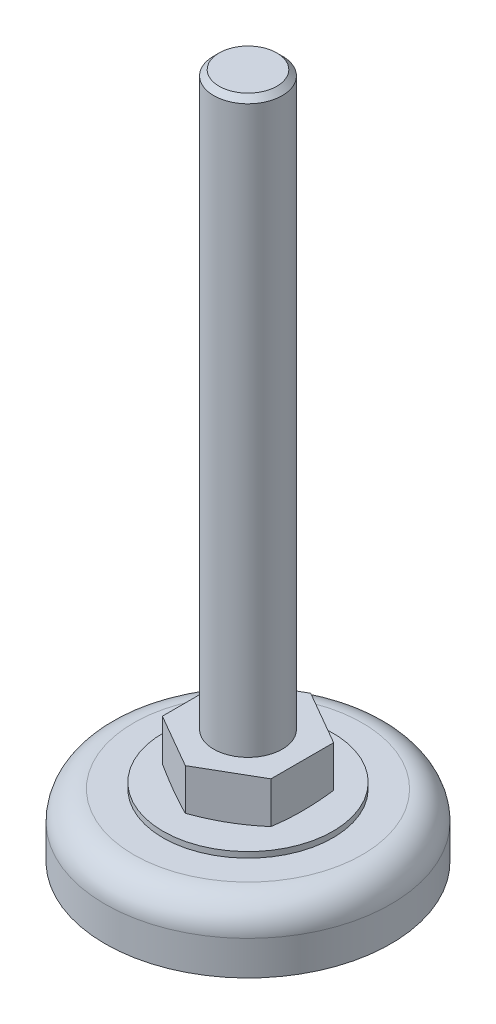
ISO-10303-21;
HEADER;
FILE_DESCRIPTION(('STEP AP214'),'2;1');
FILE_NAME('part.step','',(''),(''),'','','');
FILE_SCHEMA(('AUTOMOTIVE_DESIGN { 1 0 10303 214 1 1 1 1 }'));
ENDSEC;
DATA;
#1=APPLICATION_CONTEXT('core data for automotive mechanical design processes');
#2=APPLICATION_PROTOCOL_DEFINITION('international standard','automotive_design',2000,#1);
#3=PRODUCT_CONTEXT('',#1,'mechanical');
#4=PRODUCT('Part','Part','',(#3));
#5=PRODUCT_RELATED_PRODUCT_CATEGORY('part','',(#4));
#6=PRODUCT_DEFINITION_FORMATION('','',#4);
#7=PRODUCT_DEFINITION_CONTEXT('part definition',#1,'design');
#8=PRODUCT_DEFINITION('design','',#6,#7);
#9=PRODUCT_DEFINITION_SHAPE('','',#8);
#10=(LENGTH_UNIT() NAMED_UNIT(*) SI_UNIT(.MILLI.,.METRE.));
#11=(NAMED_UNIT(*) PLANE_ANGLE_UNIT() SI_UNIT($,.RADIAN.));
#12=(NAMED_UNIT(*) SI_UNIT($,.STERADIAN.) SOLID_ANGLE_UNIT());
#13=UNCERTAINTY_MEASURE_WITH_UNIT(LENGTH_MEASURE(1.E-05),#10,'distance_accuracy_value','');
#14=(GEOMETRIC_REPRESENTATION_CONTEXT(3) GLOBAL_UNCERTAINTY_ASSIGNED_CONTEXT((#13)) GLOBAL_UNIT_ASSIGNED_CONTEXT((#10,
#11,#12)) REPRESENTATION_CONTEXT('',''));
#15=CARTESIAN_POINT('',(0.,0.,0.));
#16=DIRECTION('',(0.,0.,1.));
#17=DIRECTION('',(1.,0.,0.));
#18=AXIS2_PLACEMENT_3D('',#15,#16,#17);
#19=CARTESIAN_POINT('',(0.,16.,0.));
#20=DIRECTION('',(0.,1.,0.));
#21=DIRECTION('',(0.,0.,1.));
#22=AXIS2_PLACEMENT_3D('',#19,#20,#21);
#23=CONICAL_SURFACE('',#22,8.,1.31824205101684);
#24=CARTESIAN_POINT('',(-9.5,18.4064858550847,-14.4882788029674));
#25=CARTESIAN_POINT('',(-9.5,18.3135363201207,-14.057459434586));
#26=CARTESIAN_POINT('',(-9.5,18.2217313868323,-13.626388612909));
#27=CARTESIAN_POINT('',(-9.5,18.0410270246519,-12.7636209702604));
#28=CARTESIAN_POINT('',(-9.5,17.9521277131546,-12.33192412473));
#29=CARTESIAN_POINT('',(-9.5,17.7777787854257,-11.467420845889));
#30=CARTESIAN_POINT('',(-9.5,17.692332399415,-11.0346137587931));
#31=CARTESIAN_POINT('',(-9.5,17.5258079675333,-10.1681604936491));
#32=CARTESIAN_POINT('',(-9.5,17.4447298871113,-9.73451432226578));
#33=CARTESIAN_POINT('',(-9.5,17.2885608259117,-8.86946261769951));
#34=CARTESIAN_POINT('',(-9.5,17.2134298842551,-8.43806433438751));
#35=CARTESIAN_POINT('',(-9.5,17.0697621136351,-7.57417304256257));
#36=CARTESIAN_POINT('',(-9.5,17.001225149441,-7.1416800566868));
#37=CARTESIAN_POINT('',(-9.5,16.8722886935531,-6.27552430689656));
#38=CARTESIAN_POINT('',(-9.5,16.8118882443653,-5.84186168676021));
#39=CARTESIAN_POINT('',(-9.5,16.7010024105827,-4.97325626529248));
#40=CARTESIAN_POINT('',(-9.5,16.6505170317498,-4.5383134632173));
#41=CARTESIAN_POINT('',(-9.5,16.5609238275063,-3.66262834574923));
#42=CARTESIAN_POINT('',(-9.5,16.5219409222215,-3.22187305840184));
#43=CARTESIAN_POINT('',(-9.5,16.4579683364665,-2.33933938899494));
#44=CARTESIAN_POINT('',(-9.5,16.4329783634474,-1.89756102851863));
#45=CARTESIAN_POINT('',(-9.5,16.398434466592,-1.01357299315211));
#46=CARTESIAN_POINT('',(-9.5,16.3888741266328,-0.57136357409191));
#47=CARTESIAN_POINT('',(-9.5,16.3857723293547,0.313112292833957));
#48=CARTESIAN_POINT('',(-9.5,16.3922308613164,0.755378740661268));
#49=CARTESIAN_POINT('',(-9.5,16.4208049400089,1.6409057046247));
#50=CARTESIAN_POINT('',(-9.5,16.442973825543,2.08416446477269));
#51=CARTESIAN_POINT('',(-9.5,16.50171377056,2.9697178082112));
#52=CARTESIAN_POINT('',(-9.5,16.5382851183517,3.41201237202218));
#53=CARTESIAN_POINT('',(-9.5,16.6239980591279,4.29563026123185));
#54=CARTESIAN_POINT('',(-9.5,16.6731471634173,4.73695284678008));
#55=CARTESIAN_POINT('',(-9.5,16.7819865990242,5.61828182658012));
#56=CARTESIAN_POINT('',(-9.5,16.8416769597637,6.05828821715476));
#57=CARTESIAN_POINT('',(-9.5,16.9661091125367,6.91238282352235));
#58=CARTESIAN_POINT('',(-9.5,17.0303797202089,7.32654037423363));
#59=CARTESIAN_POINT('',(-9.5,17.1652324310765,8.15383175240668));
#60=CARTESIAN_POINT('',(-9.5,17.2358146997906,8.5669655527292));
#61=CARTESIAN_POINT('',(-9.5,17.382132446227,9.39235635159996));
#62=CARTESIAN_POINT('',(-9.5,17.4578684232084,9.80461326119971));
#63=CARTESIAN_POINT('',(-9.5,17.6135388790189,10.6283269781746));
#64=CARTESIAN_POINT('',(-9.5,17.6934733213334,11.039783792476));
#65=CARTESIAN_POINT('',(-9.5,17.8567973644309,11.8621121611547));
#66=CARTESIAN_POINT('',(-9.5,17.9401877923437,12.2729835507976));
#67=CARTESIAN_POINT('',(-9.5,18.1098011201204,13.0941421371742));
#68=CARTESIAN_POINT('',(-9.5,18.196024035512,13.5044293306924));
#69=CARTESIAN_POINT('',(-9.5,18.4581734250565,14.7344932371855));
#70=CARTESIAN_POINT('',(-9.5,18.6375912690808,15.5535255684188));
#71=CARTESIAN_POINT('',(-9.5,19.0012065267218,17.1825154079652));
#72=CARTESIAN_POINT('',(-9.5,19.1853438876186,17.9924864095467));
#73=CARTESIAN_POINT('',(-9.5,19.5582304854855,19.6113792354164));
#74=CARTESIAN_POINT('',(-9.5,19.7469798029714,20.4203010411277));
#75=CARTESIAN_POINT('',(-9.5,20.1276507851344,22.0363851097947));
#76=CARTESIAN_POINT('',(-9.5,20.3195684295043,22.8435483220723));
#77=CARTESIAN_POINT('',(-9.5,20.7060161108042,24.4572229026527));
#78=CARTESIAN_POINT('',(-9.5,20.9005460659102,25.2637342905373));
#79=CARTESIAN_POINT('',(-9.5,21.0959995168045,26.0700192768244));
#80=B_SPLINE_CURVE_WITH_KNOTS('',3,(#24,#25,#26,#27,#28,#29,#30,#31,#32,#33,#34,#35,#36,#37,#38,
#39,#40,#41,#42,#43,#44,#45,#46,#47,#48,#49,#50,#51,#52,#53,#54,#55,#56,#57,#58,#59,#60,#61,#62,
#63,#64,#65,#66,#67,#68,#69,#70,#71,#72,#73,#74,#75,#76,#77,#78,#79),.UNSPECIFIED.,.F.,.F.,(4,2,
2,2,2,2,2,2,2,2,2,2,2,2,2,2,2,2,2,2,2,2,2,2,2,2,2,4),(0.,1.32220188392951,2.64445712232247,
3.96792197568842,5.29137635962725,6.60501058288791,7.91861786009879,9.23207041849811,
10.5455237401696,11.8727566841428,13.1999618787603,14.5266150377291,15.8532673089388,
17.1844454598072,18.5156502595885,19.8476519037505,21.1796572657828,22.4369438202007,
23.6942633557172,24.9517048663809,26.2091354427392,27.466868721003,28.7246088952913,
31.2399261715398,33.7318247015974,36.2237667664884,38.7127586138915,41.2016726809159),.UNSPECIFIED.);
#81=CARTESIAN_POINT('',(-9.5,16.7663626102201,5.48482755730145));
#82=VERTEX_POINT('',#81);
#83=CARTESIAN_POINT('',(-9.5,16.7663626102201,-5.48482755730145));
#84=VERTEX_POINT('',#83);
#85=EDGE_CURVE('E150',#82,#84,#80,.F.);
#86=ORIENTED_EDGE('',*,*,#85,.T.);
#87=CARTESIAN_POINT('',(-9.5002,16.7663924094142,-5.48471208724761));
#88=CARTESIAN_POINT('',(-9.10557748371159,16.7075718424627,-5.71254750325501));
#89=CARTESIAN_POINT('',(-8.71029047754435,16.6541818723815,-5.94076656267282));
#90=CARTESIAN_POINT('',(-7.91842136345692,16.5603919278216,-6.39795240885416));
#91=CARTESIAN_POINT('',(-7.52183882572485,16.5199968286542,-6.62691944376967));
#92=CARTESIAN_POINT('',(-6.72961048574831,16.4545299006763,-7.08431268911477));
#93=CARTESIAN_POINT('',(-6.33396929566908,16.429385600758,-7.31273623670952));
#94=CARTESIAN_POINT('',(-5.54221867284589,16.3956705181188,-7.76985367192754));
#95=CARTESIAN_POINT('',(-5.14610933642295,16.3870967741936,-7.99854750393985));
#96=CARTESIAN_POINT('',(-4.35389066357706,16.3870967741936,-8.45593516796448));
#97=CARTESIAN_POINT('',(-3.95778132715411,16.3956705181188,-8.68462899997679));
#98=CARTESIAN_POINT('',(-3.16603070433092,16.429385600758,-9.14174643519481));
#99=CARTESIAN_POINT('',(-2.77038951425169,16.4545299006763,-9.37016998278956));
#100=CARTESIAN_POINT('',(-1.97816117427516,16.5199968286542,-9.82756322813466));
#101=CARTESIAN_POINT('',(-1.58157863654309,16.5603919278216,-10.0565302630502));
#102=CARTESIAN_POINT('',(-0.789709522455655,16.6541818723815,-10.5137161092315));
#103=CARTESIAN_POINT('',(-0.394422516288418,16.7075718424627,-10.7419351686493));
#104=CARTESIAN_POINT('',(0.000199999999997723,16.7663924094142,-10.9697705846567));
#105=B_SPLINE_CURVE_WITH_KNOTS('',3,(#87,#88,#89,#90,#91,#92,#93,#94,#95,#96,#97,#98,#99,#100,
#101,#102,#103,#104),.UNSPECIFIED.,.F.,.F.,(4,2,2,2,2,2,2,2,4),(0.,1.37842136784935,
2.75735927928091,4.12969212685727,5.50177971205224,6.8738672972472,8.24620014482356,
9.62513805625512,11.0035594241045),.UNSPECIFIED.);
#106=CARTESIAN_POINT('',(0.,16.7663626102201,-10.9696551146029));
#107=VERTEX_POINT('',#106);
#108=EDGE_CURVE('E159',#84,#107,#105,.T.);
#109=ORIENTED_EDGE('',*,*,#108,.T.);
#110=CARTESIAN_POINT('',(-0.0002,16.7663924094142,-10.9697705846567));
#111=CARTESIAN_POINT('',(0.394422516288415,16.7075718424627,-10.7419351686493));
#112=CARTESIAN_POINT('',(0.789709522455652,16.6541818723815,-10.5137161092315));
#113=CARTESIAN_POINT('',(1.58157863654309,16.5603919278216,-10.0565302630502));
#114=CARTESIAN_POINT('',(1.97816117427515,16.5199968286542,-9.82756322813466));
#115=CARTESIAN_POINT('',(2.77038951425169,16.4545299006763,-9.37016998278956));
#116=CARTESIAN_POINT('',(3.16603070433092,16.429385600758,-9.14174643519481));
#117=CARTESIAN_POINT('',(3.95778132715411,16.3956705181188,-8.68462899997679));
#118=CARTESIAN_POINT('',(4.35389066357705,16.3870967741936,-8.45593516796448));
#119=CARTESIAN_POINT('',(5.14610933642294,16.3870967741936,-7.99854750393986));
#120=CARTESIAN_POINT('',(5.54221867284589,16.3956705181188,-7.76985367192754));
#121=CARTESIAN_POINT('',(6.33396929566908,16.429385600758,-7.31273623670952));
#122=CARTESIAN_POINT('',(6.72961048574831,16.4545299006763,-7.08431268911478));
#123=CARTESIAN_POINT('',(7.52183882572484,16.5199968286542,-6.62691944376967));
#124=CARTESIAN_POINT('',(7.91842136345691,16.5603919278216,-6.39795240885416));
#125=CARTESIAN_POINT('',(8.71029047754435,16.6541818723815,-5.94076656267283));
#126=CARTESIAN_POINT('',(9.10557748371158,16.7075718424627,-5.71254750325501));
#127=CARTESIAN_POINT('',(9.5002,16.7663924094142,-5.48471208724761));
#128=B_SPLINE_CURVE_WITH_KNOTS('',3,(#110,#111,#112,#113,#114,#115,#116,#117,#118,#119,#120,
#121,#122,#123,#124,#125,#126,#127),.UNSPECIFIED.,.F.,.F.,(4,2,2,2,2,2,2,2,4),(0.,
1.37842136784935,2.75735927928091,4.12969212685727,5.50177971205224,6.8738672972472,
8.24620014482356,9.62513805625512,11.0035594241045),.UNSPECIFIED.);
#129=CARTESIAN_POINT('',(9.5,16.7663626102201,-5.48482755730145));
#130=VERTEX_POINT('',#129);
#131=EDGE_CURVE('E92',#107,#130,#128,.T.);
#132=ORIENTED_EDGE('',*,*,#131,.T.);
#133=CARTESIAN_POINT('',(9.5,18.4064858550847,-14.4882788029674));
#134=CARTESIAN_POINT('',(9.5,18.3135363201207,-14.057459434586));
#135=CARTESIAN_POINT('',(9.5,18.2217313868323,-13.626388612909));
#136=CARTESIAN_POINT('',(9.5,18.0410270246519,-12.7636209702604));
#137=CARTESIAN_POINT('',(9.5,17.9521277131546,-12.33192412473));
#138=CARTESIAN_POINT('',(9.5,17.7777787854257,-11.467420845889));
#139=CARTESIAN_POINT('',(9.5,17.692332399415,-11.0346137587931));
#140=CARTESIAN_POINT('',(9.5,17.5258079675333,-10.1681604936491));
#141=CARTESIAN_POINT('',(9.5,17.4447298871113,-9.73451432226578));
#142=CARTESIAN_POINT('',(9.5,17.2885608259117,-8.86946261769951));
#143=CARTESIAN_POINT('',(9.5,17.2134298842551,-8.43806433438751));
#144=CARTESIAN_POINT('',(9.5,17.0697621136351,-7.57417304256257));
#145=CARTESIAN_POINT('',(9.5,17.001225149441,-7.1416800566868));
#146=CARTESIAN_POINT('',(9.5,16.8722886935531,-6.27552430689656));
#147=CARTESIAN_POINT('',(9.5,16.8118882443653,-5.84186168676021));
#148=CARTESIAN_POINT('',(9.5,16.7010024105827,-4.97325626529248));
#149=CARTESIAN_POINT('',(9.5,16.6505170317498,-4.5383134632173));
#150=CARTESIAN_POINT('',(9.5,16.5609238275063,-3.66262834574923));
#151=CARTESIAN_POINT('',(9.5,16.5219409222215,-3.22187305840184));
#152=CARTESIAN_POINT('',(9.5,16.4579683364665,-2.33933938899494));
#153=CARTESIAN_POINT('',(9.5,16.4329783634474,-1.89756102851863));
#154=CARTESIAN_POINT('',(9.5,16.398434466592,-1.01357299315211));
#155=CARTESIAN_POINT('',(9.5,16.3888741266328,-0.57136357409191));
#156=CARTESIAN_POINT('',(9.5,16.3857723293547,0.313112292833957));
#157=CARTESIAN_POINT('',(9.5,16.3922308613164,0.755378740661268));
#158=CARTESIAN_POINT('',(9.5,16.4208049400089,1.6409057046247));
#159=CARTESIAN_POINT('',(9.5,16.442973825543,2.08416446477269));
#160=CARTESIAN_POINT('',(9.5,16.50171377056,2.9697178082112));
#161=CARTESIAN_POINT('',(9.5,16.5382851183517,3.41201237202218));
#162=CARTESIAN_POINT('',(9.5,16.6239980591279,4.29563026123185));
#163=CARTESIAN_POINT('',(9.5,16.6731471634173,4.73695284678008));
#164=CARTESIAN_POINT('',(9.5,16.7819865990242,5.61828182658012));
#165=CARTESIAN_POINT('',(9.5,16.8416769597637,6.05828821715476));
#166=CARTESIAN_POINT('',(9.5,16.9661091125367,6.91238282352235));
#167=CARTESIAN_POINT('',(9.5,17.0303797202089,7.32654037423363));
#168=CARTESIAN_POINT('',(9.5,17.1652324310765,8.15383175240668));
#169=CARTESIAN_POINT('',(9.5,17.2358146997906,8.5669655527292));
#170=CARTESIAN_POINT('',(9.5,17.382132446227,9.39235635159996));
#171=CARTESIAN_POINT('',(9.5,17.4578684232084,9.80461326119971));
#172=CARTESIAN_POINT('',(9.5,17.6135388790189,10.6283269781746));
#173=CARTESIAN_POINT('',(9.5,17.6934733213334,11.039783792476));
#174=CARTESIAN_POINT('',(9.5,17.8567973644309,11.8621121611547));
#175=CARTESIAN_POINT('',(9.5,17.9401877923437,12.2729835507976));
#176=CARTESIAN_POINT('',(9.5,18.1098011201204,13.0941421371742));
#177=CARTESIAN_POINT('',(9.5,18.196024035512,13.5044293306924));
#178=CARTESIAN_POINT('',(9.5,18.4581734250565,14.7344932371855));
#179=CARTESIAN_POINT('',(9.5,18.6375912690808,15.5535255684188));
#180=CARTESIAN_POINT('',(9.5,19.0012065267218,17.1825154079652));
#181=CARTESIAN_POINT('',(9.5,19.1853438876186,17.9924864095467));
#182=CARTESIAN_POINT('',(9.5,19.5582304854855,19.6113792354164));
#183=CARTESIAN_POINT('',(9.5,19.7469798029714,20.4203010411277));
#184=CARTESIAN_POINT('',(9.5,20.1276507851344,22.0363851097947));
#185=CARTESIAN_POINT('',(9.5,20.3195684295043,22.8435483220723));
#186=CARTESIAN_POINT('',(9.5,20.7060161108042,24.4572229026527));
#187=CARTESIAN_POINT('',(9.5,20.9005460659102,25.2637342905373));
#188=CARTESIAN_POINT('',(9.5,21.0959995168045,26.0700192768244));
#189=B_SPLINE_CURVE_WITH_KNOTS('',3,(#133,#134,#135,#136,#137,#138,#139,#140,#141,#142,#143,
#144,#145,#146,#147,#148,#149,#150,#151,#152,#153,#154,#155,#156,#157,#158,#159,#160,#161,#162,
#163,#164,#165,#166,#167,#168,#169,#170,#171,#172,#173,#174,#175,#176,#177,#178,#179,#180,#181,
#182,#183,#184,#185,#186,#187,#188),.UNSPECIFIED.,.F.,.F.,(4,2,2,2,2,2,2,2,2,2,2,2,2,2,2,2,2,2,
2,2,2,2,2,2,2,2,2,4),(0.,1.32220188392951,2.64445712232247,3.96792197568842,5.29137635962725,
6.60501058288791,7.91861786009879,9.23207041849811,10.5455237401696,11.8727566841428,
13.1999618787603,14.5266150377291,15.8532673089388,17.1844454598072,18.5156502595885,
19.8476519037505,21.1796572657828,22.4369438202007,23.6942633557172,24.9517048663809,
26.2091354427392,27.466868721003,28.7246088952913,31.2399261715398,33.7318247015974,
36.2237667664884,38.7127586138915,41.2016726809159),.UNSPECIFIED.);
#190=CARTESIAN_POINT('',(9.5,16.7663626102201,5.48482755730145));
#191=VERTEX_POINT('',#190);
#192=EDGE_CURVE('E91',#130,#191,#189,.T.);
#193=ORIENTED_EDGE('',*,*,#192,.T.);
#194=CARTESIAN_POINT('',(9.5002,16.7663924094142,5.48471208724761));
#195=CARTESIAN_POINT('',(9.10557748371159,16.7075718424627,5.71254750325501));
#196=CARTESIAN_POINT('',(8.71029047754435,16.6541818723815,5.94076656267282));
#197=CARTESIAN_POINT('',(7.91842136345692,16.5603919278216,6.39795240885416));
#198=CARTESIAN_POINT('',(7.52183882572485,16.5199968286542,6.62691944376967));
#199=CARTESIAN_POINT('',(6.72961048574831,16.4545299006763,7.08431268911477));
#200=CARTESIAN_POINT('',(6.33396929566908,16.429385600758,7.31273623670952));
#201=CARTESIAN_POINT('',(5.54221867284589,16.3956705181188,7.76985367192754));
#202=CARTESIAN_POINT('',(5.14610933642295,16.3870967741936,7.99854750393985));
#203=CARTESIAN_POINT('',(4.35389066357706,16.3870967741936,8.45593516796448));
#204=CARTESIAN_POINT('',(3.95778132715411,16.3956705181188,8.68462899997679));
#205=CARTESIAN_POINT('',(3.16603070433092,16.429385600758,9.14174643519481));
#206=CARTESIAN_POINT('',(2.77038951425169,16.4545299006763,9.37016998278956));
#207=CARTESIAN_POINT('',(1.97816117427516,16.5199968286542,9.82756322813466));
#208=CARTESIAN_POINT('',(1.58157863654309,16.5603919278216,10.0565302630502));
#209=CARTESIAN_POINT('',(0.789709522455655,16.6541818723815,10.5137161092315));
#210=CARTESIAN_POINT('',(0.394422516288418,16.7075718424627,10.7419351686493));
#211=CARTESIAN_POINT('',(-0.000199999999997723,16.7663924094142,10.9697705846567));
#212=B_SPLINE_CURVE_WITH_KNOTS('',3,(#194,#195,#196,#197,#198,#199,#200,#201,#202,#203,#204,
#205,#206,#207,#208,#209,#210,#211),.UNSPECIFIED.,.F.,.F.,(4,2,2,2,2,2,2,2,4),(0.,
1.37842136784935,2.75735927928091,4.12969212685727,5.50177971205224,6.8738672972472,
8.24620014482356,9.62513805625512,11.0035594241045),.UNSPECIFIED.);
#213=CARTESIAN_POINT('',(0.,16.7663626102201,10.9696551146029));
#214=VERTEX_POINT('',#213);
#215=EDGE_CURVE('E108',#191,#214,#212,.T.);
#216=ORIENTED_EDGE('',*,*,#215,.T.);
#217=CARTESIAN_POINT('',(0.0002,16.7663924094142,10.9697705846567));
#218=CARTESIAN_POINT('',(-0.394422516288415,16.7075718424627,10.7419351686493));
#219=CARTESIAN_POINT('',(-0.789709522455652,16.6541818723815,10.5137161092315));
#220=CARTESIAN_POINT('',(-1.58157863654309,16.5603919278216,10.0565302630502));
#221=CARTESIAN_POINT('',(-1.97816117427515,16.5199968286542,9.82756322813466));
#222=CARTESIAN_POINT('',(-2.77038951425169,16.4545299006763,9.37016998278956));
#223=CARTESIAN_POINT('',(-3.16603070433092,16.429385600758,9.14174643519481));
#224=CARTESIAN_POINT('',(-3.95778132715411,16.3956705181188,8.68462899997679));
#225=CARTESIAN_POINT('',(-4.35389066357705,16.3870967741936,8.45593516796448));
#226=CARTESIAN_POINT('',(-5.14610933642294,16.3870967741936,7.99854750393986));
#227=CARTESIAN_POINT('',(-5.54221867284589,16.3956705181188,7.76985367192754));
#228=CARTESIAN_POINT('',(-6.33396929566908,16.429385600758,7.31273623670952));
#229=CARTESIAN_POINT('',(-6.72961048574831,16.4545299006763,7.08431268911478));
#230=CARTESIAN_POINT('',(-7.52183882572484,16.5199968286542,6.62691944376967));
#231=CARTESIAN_POINT('',(-7.91842136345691,16.5603919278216,6.39795240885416));
#232=CARTESIAN_POINT('',(-8.71029047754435,16.6541818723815,5.94076656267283));
#233=CARTESIAN_POINT('',(-9.10557748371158,16.7075718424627,5.71254750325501));
#234=CARTESIAN_POINT('',(-9.5002,16.7663924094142,5.48471208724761));
#235=B_SPLINE_CURVE_WITH_KNOTS('',3,(#217,#218,#219,#220,#221,#222,#223,#224,#225,#226,#227,
#228,#229,#230,#231,#232,#233,#234),.UNSPECIFIED.,.F.,.F.,(4,2,2,2,2,2,2,2,4),(0.,
1.37842136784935,2.75735927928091,4.12969212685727,5.50177971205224,6.8738672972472,
8.24620014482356,9.62513805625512,11.0035594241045),.UNSPECIFIED.);
#236=EDGE_CURVE('E142',#214,#82,#235,.T.);
#237=ORIENTED_EDGE('',*,*,#236,.T.);
#238=EDGE_LOOP('',(#86,#109,#132,#193,#216,#237));
#239=FACE_BOUND('',#238,.T.);
#240=CARTESIAN_POINT('',(0.,16.,0.));
#241=DIRECTION('',(0.,1.,0.));
#242=DIRECTION('',(0.,0.,1.));
#243=AXIS2_PLACEMENT_3D('',#240,#241,#242);
#244=CIRCLE('',#243,8.);
#245=CARTESIAN_POINT('',(0.,16.,8.));
#246=VERTEX_POINT('',#245);
#247=EDGE_CURVE('E217',#246,#246,#244,.T.);
#248=ORIENTED_EDGE('',*,*,#247,.T.);
#249=EDGE_LOOP('',(#248));
#250=FACE_BOUND('',#249,.T.);
#251=ADVANCED_FACE('F36',(#239,#250),#23,.T.);
#252=CARTESIAN_POINT('',(8.,16.,0.));
#253=DIRECTION('',(0.,-1.,0.));
#254=DIRECTION('',(0.,0.,-1.));
#255=AXIS2_PLACEMENT_3D('',#252,#253,#254);
#256=PLANE('',#255);
#257=ORIENTED_EDGE('',*,*,#247,.F.);
#258=EDGE_LOOP('',(#257));
#259=FACE_BOUND('',#258,.T.);
#260=CARTESIAN_POINT('',(0.,16.,0.));
#261=DIRECTION('',(0.,1.,0.));
#262=DIRECTION('',(0.,0.,1.));
#263=AXIS2_PLACEMENT_3D('',#260,#261,#262);
#264=CIRCLE('',#263,14.875);
#265=CARTESIAN_POINT('',(0.,16.,14.875));
#266=VERTEX_POINT('',#265);
#267=EDGE_CURVE('E220',#266,#266,#264,.T.);
#268=ORIENTED_EDGE('',*,*,#267,.T.);
#269=EDGE_LOOP('',(#268));
#270=FACE_BOUND('',#269,.T.);
#271=ADVANCED_FACE('F206',(#259,#270),#256,.F.);
#272=CARTESIAN_POINT('',(0.,0.,0.));
#273=DIRECTION('',(0.,1.,0.));
#274=DIRECTION('',(0.,0.,1.));
#275=AXIS2_PLACEMENT_3D('',#272,#273,#274);
#276=CYLINDRICAL_SURFACE('',#275,14.875);
#277=ORIENTED_EDGE('',*,*,#267,.F.);
#278=EDGE_LOOP('',(#277));
#279=FACE_BOUND('',#278,.T.);
#280=CARTESIAN_POINT('',(0.,15.,0.));
#281=DIRECTION('',(0.,1.,0.));
#282=DIRECTION('',(0.,0.,1.));
#283=AXIS2_PLACEMENT_3D('',#280,#281,#282);
#284=CIRCLE('',#283,14.875);
#285=CARTESIAN_POINT('',(0.,15.,14.875));
#286=VERTEX_POINT('',#285);
#287=EDGE_CURVE('E221',#286,#286,#284,.T.);
#288=ORIENTED_EDGE('',*,*,#287,.T.);
#289=EDGE_LOOP('',(#288));
#290=FACE_BOUND('',#289,.T.);
#291=ADVANCED_FACE('F203',(#279,#290),#276,.T.);
#292=CARTESIAN_POINT('',(14.875,15.,0.));
#293=DIRECTION('',(0.,-1.,0.));
#294=DIRECTION('',(0.,0.,-1.));
#295=AXIS2_PLACEMENT_3D('',#292,#293,#294);
#296=PLANE('',#295);
#297=ORIENTED_EDGE('',*,*,#287,.F.);
#298=EDGE_LOOP('',(#297));
#299=FACE_BOUND('',#298,.T.);
#300=CARTESIAN_POINT('',(0.,15.,0.));
#301=DIRECTION('',(0.,1.,0.));
#302=DIRECTION('',(0.,0.,1.));
#303=AXIS2_PLACEMENT_3D('',#300,#301,#302);
#304=CIRCLE('',#303,20.);
#305=CARTESIAN_POINT('',(0.,15.,20.));
#306=VERTEX_POINT('',#305);
#307=EDGE_CURVE('E226',#306,#306,#304,.T.);
#308=ORIENTED_EDGE('',*,*,#307,.T.);
#309=EDGE_LOOP('',(#308));
#310=FACE_BOUND('',#309,.T.);
#311=ADVANCED_FACE('F199',(#299,#310),#296,.F.);
#312=CARTESIAN_POINT('',(0.,10.,0.));
#313=DIRECTION('',(0.,1.,0.));
#314=DIRECTION('',(0.,0.,1.));
#315=AXIS2_PLACEMENT_3D('',#312,#313,#314);
#316=TOROIDAL_SURFACE('',#315,20.,5.);
#317=ORIENTED_EDGE('',*,*,#307,.F.);
#318=EDGE_LOOP('',(#317));
#319=FACE_BOUND('',#318,.T.);
#320=CARTESIAN_POINT('',(0.,10.,0.));
#321=DIRECTION('',(0.,1.,0.));
#322=DIRECTION('',(0.,0.,1.));
#323=AXIS2_PLACEMENT_3D('',#320,#321,#322);
#324=CIRCLE('',#323,25.);
#325=CARTESIAN_POINT('',(0.,10.,25.));
#326=VERTEX_POINT('',#325);
#327=EDGE_CURVE('E295',#326,#326,#324,.T.);
#328=ORIENTED_EDGE('',*,*,#327,.T.);
#329=EDGE_LOOP('',(#328));
#330=FACE_BOUND('',#329,.T.);
#331=ADVANCED_FACE('F195',(#319,#330),#316,.T.);
#332=CARTESIAN_POINT('',(0.,0.,0.));
#333=DIRECTION('',(0.,1.,0.));
#334=DIRECTION('',(0.,0.,1.));
#335=AXIS2_PLACEMENT_3D('',#332,#333,#334);
#336=CYLINDRICAL_SURFACE('',#335,25.);
#337=ORIENTED_EDGE('',*,*,#327,.F.);
#338=EDGE_LOOP('',(#337));
#339=FACE_BOUND('',#338,.T.);
#340=CARTESIAN_POINT('',(0.,4.,0.));
#341=DIRECTION('',(0.,1.,0.));
#342=DIRECTION('',(0.,0.,1.));
#343=AXIS2_PLACEMENT_3D('',#340,#341,#342);
#344=CIRCLE('',#343,25.);
#345=CARTESIAN_POINT('',(0.,4.,25.));
#346=VERTEX_POINT('',#345);
#347=EDGE_CURVE('E292',#346,#346,#344,.T.);
#348=ORIENTED_EDGE('',*,*,#347,.T.);
#349=EDGE_LOOP('',(#348));
#350=FACE_BOUND('',#349,.T.);
#351=ADVANCED_FACE('F191',(#339,#350),#336,.T.);
#352=CARTESIAN_POINT('',(25.,4.,0.));
#353=DIRECTION('',(0.,1.,0.));
#354=DIRECTION('',(0.,0.,1.));
#355=AXIS2_PLACEMENT_3D('',#352,#353,#354);
#356=PLANE('',#355);
#357=ORIENTED_EDGE('',*,*,#347,.F.);
#358=EDGE_LOOP('',(#357));
#359=FACE_BOUND('',#358,.T.);
#360=CARTESIAN_POINT('',(0.,4.,0.));
#361=DIRECTION('',(0.,1.,0.));
#362=DIRECTION('',(0.,0.,1.));
#363=AXIS2_PLACEMENT_3D('',#360,#361,#362);
#364=CIRCLE('',#363,18.5);
#365=CARTESIAN_POINT('',(0.,4.,18.5));
#366=VERTEX_POINT('',#365);
#367=EDGE_CURVE('E289',#366,#366,#364,.T.);
#368=ORIENTED_EDGE('',*,*,#367,.T.);
#369=EDGE_LOOP('',(#368));
#370=FACE_BOUND('',#369,.T.);
#371=ADVANCED_FACE('F187',(#359,#370),#356,.F.);
#372=CARTESIAN_POINT('',(0.,0.,0.));
#373=DIRECTION('',(0.,1.,0.));
#374=DIRECTION('',(0.,0.,1.));
#375=AXIS2_PLACEMENT_3D('',#372,#373,#374);
#376=CYLINDRICAL_SURFACE('',#375,18.5);
#377=ORIENTED_EDGE('',*,*,#367,.F.);
#378=EDGE_LOOP('',(#377));
#379=FACE_BOUND('',#378,.T.);
#380=CARTESIAN_POINT('',(0.,0.,0.));
#381=DIRECTION('',(0.,1.,0.));
#382=DIRECTION('',(0.,0.,1.));
#383=AXIS2_PLACEMENT_3D('',#380,#381,#382);
#384=CIRCLE('',#383,18.5);
#385=CARTESIAN_POINT('',(0.,0.,18.5));
#386=VERTEX_POINT('',#385);
#387=EDGE_CURVE('E284',#386,#386,#384,.T.);
#388=ORIENTED_EDGE('',*,*,#387,.T.);
#389=EDGE_LOOP('',(#388));
#390=FACE_BOUND('',#389,.T.);
#391=ADVANCED_FACE('F183',(#379,#390),#376,.T.);
#392=CARTESIAN_POINT('',(18.5,0.,0.));
#393=DIRECTION('',(0.,1.,0.));
#394=DIRECTION('',(0.,0.,1.));
#395=AXIS2_PLACEMENT_3D('',#392,#393,#394);
#396=PLANE('',#395);
#397=ORIENTED_EDGE('',*,*,#387,.F.);
#398=EDGE_LOOP('',(#397));
#399=FACE_BOUND('',#398,.T.);
#400=CARTESIAN_POINT('',(0.,0.,0.));
#401=DIRECTION('',(0.,1.,0.));
#402=DIRECTION('',(0.,0.,1.));
#403=AXIS2_PLACEMENT_3D('',#400,#401,#402);
#404=CIRCLE('',#403,7.5);
#405=CARTESIAN_POINT('',(0.,0.,7.5));
#406=VERTEX_POINT('',#405);
#407=EDGE_CURVE('E280',#406,#406,#404,.T.);
#408=ORIENTED_EDGE('',*,*,#407,.T.);
#409=EDGE_LOOP('',(#408));
#410=FACE_BOUND('',#409,.T.);
#411=ADVANCED_FACE('F179',(#399,#410),#396,.F.);
#412=CARTESIAN_POINT('',(0.,0.,0.));
#413=DIRECTION('',(0.,1.,0.));
#414=DIRECTION('',(0.,0.,1.));
#415=AXIS2_PLACEMENT_3D('',#412,#413,#414);
#416=CYLINDRICAL_SURFACE('',#415,7.5);
#417=ORIENTED_EDGE('',*,*,#407,.F.);
#418=EDGE_LOOP('',(#417));
#419=FACE_BOUND('',#418,.T.);
#420=CARTESIAN_POINT('',(0.,4.,0.));
#421=DIRECTION('',(0.,1.,0.));
#422=DIRECTION('',(0.,0.,1.));
#423=AXIS2_PLACEMENT_3D('',#420,#421,#422);
#424=CIRCLE('',#423,7.5);
#425=CARTESIAN_POINT('',(0.,4.,7.5));
#426=VERTEX_POINT('',#425);
#427=EDGE_CURVE('E278',#426,#426,#424,.T.);
#428=ORIENTED_EDGE('',*,*,#427,.T.);
#429=EDGE_LOOP('',(#428));
#430=FACE_BOUND('',#429,.T.);
#431=ADVANCED_FACE('F175',(#419,#430),#416,.F.);
#432=CARTESIAN_POINT('',(7.5,4.,0.));
#433=DIRECTION('',(0.,1.,0.));
#434=DIRECTION('',(0.,0.,1.));
#435=AXIS2_PLACEMENT_3D('',#432,#433,#434);
#436=PLANE('',#435);
#437=ORIENTED_EDGE('',*,*,#427,.F.);
#438=EDGE_LOOP('',(#437));
#439=FACE_BOUND('',#438,.T.);
#440=ADVANCED_FACE('F171',(#439),#436,.F.);
#441=CARTESIAN_POINT('',(0.,25.,-10.9696551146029));
#442=DIRECTION('',(0.5,0.,0.866025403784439));
#443=DIRECTION('',(0.866025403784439,0.,-0.5));
#444=AXIS2_PLACEMENT_3D('',#441,#442,#443);
#445=PLANE('',#444);
#446=DIRECTION('',(0.,-1.,0.));
#447=VECTOR('',#446,1.);
#448=CARTESIAN_POINT('',(0.,25.,-10.9696551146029));
#449=LINE('',#448,#447);
#450=CARTESIAN_POINT('',(0.,24.,-10.9696551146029));
#451=VERTEX_POINT('',#450);
#452=EDGE_CURVE('E51',#451,#107,#449,.T.);
#453=ORIENTED_EDGE('',*,*,#452,.T.);
#454=ORIENTED_EDGE('',*,*,#108,.F.);
#455=DIRECTION('',(0.,-1.,0.));
#456=VECTOR('',#455,1.);
#457=CARTESIAN_POINT('',(-9.5,25.,-5.48482755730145));
#458=LINE('',#457,#456);
#459=CARTESIAN_POINT('',(-9.5,24.,-5.48482755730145));
#460=VERTEX_POINT('',#459);
#461=EDGE_CURVE('E263',#460,#84,#458,.T.);
#462=ORIENTED_EDGE('',*,*,#461,.F.);
#463=DIRECTION('',(-0.866025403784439,0.,0.5));
#464=VECTOR('',#463,1.);
#465=CARTESIAN_POINT('',(-0.249999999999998,24.,-10.8253175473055));
#466=LINE('',#465,#464);
#467=EDGE_CURVE('E165',#451,#460,#466,.T.);
#468=ORIENTED_EDGE('',*,*,#467,.F.);
#469=EDGE_LOOP('',(#453,#454,#462,#468));
#470=FACE_BOUND('',#469,.T.);
#471=ADVANCED_FACE('F167',(#470),#445,.F.);
#472=CARTESIAN_POINT('',(-9.5,25.,-5.48482755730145));
#473=DIRECTION('',(1.,0.,0.));
#474=DIRECTION('',(0.,0.,-1.));
#475=AXIS2_PLACEMENT_3D('',#472,#473,#474);
#476=PLANE('',#475);
#477=ORIENTED_EDGE('',*,*,#461,.T.);
#478=ORIENTED_EDGE('',*,*,#85,.F.);
#479=DIRECTION('',(0.,-1.,0.));
#480=VECTOR('',#479,1.);
#481=CARTESIAN_POINT('',(-9.5,25.,5.48482755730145));
#482=LINE('',#481,#480);
#483=CARTESIAN_POINT('',(-9.5,24.,5.48482755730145));
#484=VERTEX_POINT('',#483);
#485=EDGE_CURVE('E266',#484,#82,#482,.T.);
#486=ORIENTED_EDGE('',*,*,#485,.F.);
#487=DIRECTION('',(0.,0.,1.));
#488=VECTOR('',#487,1.);
#489=CARTESIAN_POINT('',(-9.5,24.,0.));
#490=LINE('',#489,#488);
#491=EDGE_CURVE('E156',#460,#484,#490,.T.);
#492=ORIENTED_EDGE('',*,*,#491,.F.);
#493=EDGE_LOOP('',(#477,#478,#486,#492));
#494=FACE_BOUND('',#493,.T.);
#495=ADVANCED_FACE('F138',(#494),#476,.F.);
#496=CARTESIAN_POINT('',(-9.5,25.,5.48482755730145));
#497=DIRECTION('',(0.5,0.,-0.866025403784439));
#498=DIRECTION('',(-0.866025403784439,0.,-0.5));
#499=AXIS2_PLACEMENT_3D('',#496,#497,#498);
#500=PLANE('',#499);
#501=ORIENTED_EDGE('',*,*,#485,.T.);
#502=ORIENTED_EDGE('',*,*,#236,.F.);
#503=DIRECTION('',(0.,-1.,0.));
#504=VECTOR('',#503,1.);
#505=CARTESIAN_POINT('',(0.,25.,10.9696551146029));
#506=LINE('',#505,#504);
#507=CARTESIAN_POINT('',(0.,24.,10.9696551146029));
#508=VERTEX_POINT('',#507);
#509=EDGE_CURVE('E269',#508,#214,#506,.T.);
#510=ORIENTED_EDGE('',*,*,#509,.F.);
#511=DIRECTION('',(0.866025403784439,0.,0.5));
#512=VECTOR('',#511,1.);
#513=CARTESIAN_POINT('',(-0.249999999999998,24.,10.8253175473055));
#514=LINE('',#513,#512);
#515=EDGE_CURVE('E148',#484,#508,#514,.T.);
#516=ORIENTED_EDGE('',*,*,#515,.F.);
#517=EDGE_LOOP('',(#501,#502,#510,#516));
#518=FACE_BOUND('',#517,.T.);
#519=ADVANCED_FACE('F131',(#518),#500,.F.);
#520=CARTESIAN_POINT('',(0.,25.,10.9696551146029));
#521=DIRECTION('',(-0.5,0.,-0.866025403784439));
#522=DIRECTION('',(-0.866025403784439,0.,0.5));
#523=AXIS2_PLACEMENT_3D('',#520,#521,#522);
#524=PLANE('',#523);
#525=ORIENTED_EDGE('',*,*,#509,.T.);
#526=ORIENTED_EDGE('',*,*,#215,.F.);
#527=DIRECTION('',(0.,-1.,0.));
#528=VECTOR('',#527,1.);
#529=CARTESIAN_POINT('',(9.5,25.,5.48482755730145));
#530=LINE('',#529,#528);
#531=CARTESIAN_POINT('',(9.5,24.,5.48482755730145));
#532=VERTEX_POINT('',#531);
#533=EDGE_CURVE('E101',#532,#191,#530,.T.);
#534=ORIENTED_EDGE('',*,*,#533,.F.);
#535=DIRECTION('',(0.866025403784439,0.,-0.5));
#536=VECTOR('',#535,1.);
#537=CARTESIAN_POINT('',(9.25,24.,5.62916512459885));
#538=LINE('',#537,#536);
#539=EDGE_CURVE('E107',#508,#532,#538,.T.);
#540=ORIENTED_EDGE('',*,*,#539,.F.);
#541=EDGE_LOOP('',(#525,#526,#534,#540));
#542=FACE_BOUND('',#541,.T.);
#543=ADVANCED_FACE('F127',(#542),#524,.F.);
#544=CARTESIAN_POINT('',(9.5,25.,5.48482755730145));
#545=DIRECTION('',(-1.,0.,0.));
#546=DIRECTION('',(0.,0.,1.));
#547=AXIS2_PLACEMENT_3D('',#544,#545,#546);
#548=PLANE('',#547);
#549=ORIENTED_EDGE('',*,*,#533,.T.);
#550=ORIENTED_EDGE('',*,*,#192,.F.);
#551=DIRECTION('',(0.,-1.,0.));
#552=VECTOR('',#551,1.);
#553=CARTESIAN_POINT('',(9.5,25.,-5.48482755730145));
#554=LINE('',#553,#552);
#555=CARTESIAN_POINT('',(9.5,24.,-5.48482755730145));
#556=VERTEX_POINT('',#555);
#557=EDGE_CURVE('E56',#556,#130,#554,.T.);
#558=ORIENTED_EDGE('',*,*,#557,.F.);
#559=DIRECTION('',(0.,0.,-1.));
#560=VECTOR('',#559,1.);
#561=CARTESIAN_POINT('',(9.5,24.,0.));
#562=LINE('',#561,#560);
#563=EDGE_CURVE('E97',#532,#556,#562,.T.);
#564=ORIENTED_EDGE('',*,*,#563,.F.);
#565=EDGE_LOOP('',(#549,#550,#558,#564));
#566=FACE_BOUND('',#565,.T.);
#567=ADVANCED_FACE('F96',(#566),#548,.F.);
#568=CARTESIAN_POINT('',(9.5,25.,-5.48482755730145));
#569=DIRECTION('',(-0.5,0.,0.866025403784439));
#570=DIRECTION('',(0.866025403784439,0.,0.5));
#571=AXIS2_PLACEMENT_3D('',#568,#569,#570);
#572=PLANE('',#571);
#573=ORIENTED_EDGE('',*,*,#557,.T.);
#574=ORIENTED_EDGE('',*,*,#131,.F.);
#575=ORIENTED_EDGE('',*,*,#452,.F.);
#576=DIRECTION('',(-0.866025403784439,0.,-0.5));
#577=VECTOR('',#576,1.);
#578=CARTESIAN_POINT('',(9.25,24.,-5.62916512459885));
#579=LINE('',#578,#577);
#580=EDGE_CURVE('E86',#556,#451,#579,.T.);
#581=ORIENTED_EDGE('',*,*,#580,.F.);
#582=EDGE_LOOP('',(#573,#574,#575,#581));
#583=FACE_BOUND('',#582,.T.);
#584=ADVANCED_FACE('F87',(#583),#572,.F.);
#585=CARTESIAN_POINT('',(0.,124.,0.));
#586=DIRECTION('',(0.,-1.,0.));
#587=DIRECTION('',(0.,0.,-1.));
#588=AXIS2_PLACEMENT_3D('',#585,#586,#587);
#589=PLANE('',#588);
#590=CARTESIAN_POINT('',(0.,124.,0.));
#591=DIRECTION('',(0.,1.,0.));
#592=DIRECTION('',(0.,0.,1.));
#593=AXIS2_PLACEMENT_3D('',#590,#591,#592);
#594=CIRCLE('',#593,5.053);
#595=CARTESIAN_POINT('',(0.,124.,5.053));
#596=VERTEX_POINT('',#595);
#597=EDGE_CURVE('E11',#596,#596,#594,.T.);
#598=ORIENTED_EDGE('',*,*,#597,.T.);
#599=EDGE_LOOP('',(#598));
#600=FACE_BOUND('',#599,.T.);
#601=ADVANCED_FACE('F38',(#600),#589,.F.);
#602=CARTESIAN_POINT('',(0.,123.053,0.));
#603=DIRECTION('',(0.,-1.,0.));
#604=DIRECTION('',(0.,0.,-1.));
#605=AXIS2_PLACEMENT_3D('',#602,#603,#604);
#606=CONICAL_SURFACE('',#605,6.,0.785398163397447);
#607=ORIENTED_EDGE('',*,*,#597,.F.);
#608=EDGE_LOOP('',(#607));
#609=FACE_BOUND('',#608,.T.);
#610=CARTESIAN_POINT('',(0.,123.053,0.));
#611=DIRECTION('',(0.,1.,0.));
#612=DIRECTION('',(0.,0.,1.));
#613=AXIS2_PLACEMENT_3D('',#610,#611,#612);
#614=CIRCLE('',#613,6.);
#615=CARTESIAN_POINT('',(0.,123.053,6.));
#616=VERTEX_POINT('',#615);
#617=EDGE_CURVE('E44',#616,#616,#614,.T.);
#618=ORIENTED_EDGE('',*,*,#617,.T.);
#619=EDGE_LOOP('',(#618));
#620=FACE_BOUND('',#619,.T.);
#621=ADVANCED_FACE('F234',(#609,#620),#606,.T.);
#622=CARTESIAN_POINT('',(0.,0.,0.));
#623=DIRECTION('',(0.,1.,0.));
#624=DIRECTION('',(0.,0.,1.));
#625=AXIS2_PLACEMENT_3D('',#622,#623,#624);
#626=CYLINDRICAL_SURFACE('',#625,6.);
#627=ORIENTED_EDGE('',*,*,#617,.F.);
#628=EDGE_LOOP('',(#627));
#629=FACE_BOUND('',#628,.T.);
#630=CARTESIAN_POINT('',(0.,24.,0.));
#631=DIRECTION('',(0.,1.,0.));
#632=DIRECTION('',(0.,0.,1.));
#633=AXIS2_PLACEMENT_3D('',#630,#631,#632);
#634=CIRCLE('',#633,6.);
#635=CARTESIAN_POINT('',(0.,24.,6.));
#636=VERTEX_POINT('',#635);
#637=EDGE_CURVE('E223',#636,#636,#634,.T.);
#638=ORIENTED_EDGE('',*,*,#637,.T.);
#639=EDGE_LOOP('',(#638));
#640=FACE_BOUND('',#639,.T.);
#641=ADVANCED_FACE('F236',(#629,#640),#626,.T.);
#642=CARTESIAN_POINT('',(6.,24.,0.));
#643=DIRECTION('',(0.,-1.,0.));
#644=DIRECTION('',(0.,0.,-1.));
#645=AXIS2_PLACEMENT_3D('',#642,#643,#644);
#646=PLANE('',#645);
#647=ORIENTED_EDGE('',*,*,#580,.T.);
#648=ORIENTED_EDGE('',*,*,#467,.T.);
#649=ORIENTED_EDGE('',*,*,#491,.T.);
#650=ORIENTED_EDGE('',*,*,#515,.T.);
#651=ORIENTED_EDGE('',*,*,#539,.T.);
#652=ORIENTED_EDGE('',*,*,#563,.T.);
#653=EDGE_LOOP('',(#647,#648,#649,#650,#651,#652));
#654=FACE_BOUND('',#653,.T.);
#655=ORIENTED_EDGE('',*,*,#637,.F.);
#656=EDGE_LOOP('',(#655));
#657=FACE_BOUND('',#656,.T.);
#658=ADVANCED_FACE('F104',(#654,#657),#646,.F.);
#659=CLOSED_SHELL('',(#251,#271,#291,#311,#331,#351,#371,#391,#411,#431,#440,#471,#495,#519,
#543,#567,#584,#601,#621,#641,#658));
#660=MANIFOLD_SOLID_BREP('B2',#659);
#661=ADVANCED_BREP_SHAPE_REPRESENTATION('',(#18,#660),#14);
#662=SHAPE_DEFINITION_REPRESENTATION(#9,#661);
ENDSEC;
END-ISO-10303-21;
